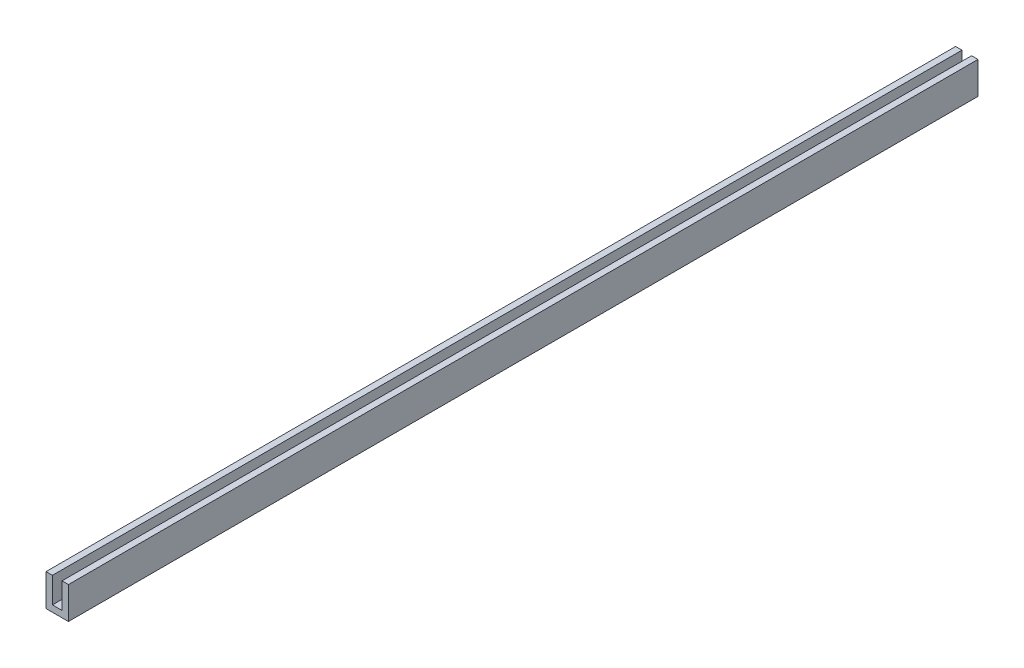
from build123d import *

# Parameters (mm, degrees)
ESQUISSE1_W             = 7
ESQUISSE1_H             = 10
EXTRUSION1_DEPTH        = 284
ESQUISSE3_W             = 3
ESQUISSE3_H             = 8
ENL_V_MAT_EXTRU_1_DEPTH = 285.262202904


with BuildPart() as part:
    # Esquisse1 → Extrusion1 (new body)
    with BuildSketch(Plane.XY):
        with Locations((3.5, 5)):
            Rectangle(ESQUISSE1_W, ESQUISSE1_H)
    extrude(amount=EXTRUSION1_DEPTH)

    # Esquisse3 → Enl_v. mat.-Extru.1 (cut, through all)
    with BuildSketch(Plane.XY.offset(284)):
        with Locations((3.5, 6)):
            Rectangle(ESQUISSE3_W, ESQUISSE3_H)
    extrude(amount=-ENL_V_MAT_EXTRU_1_DEPTH, mode=Mode.SUBTRACT)


solid = part.part
